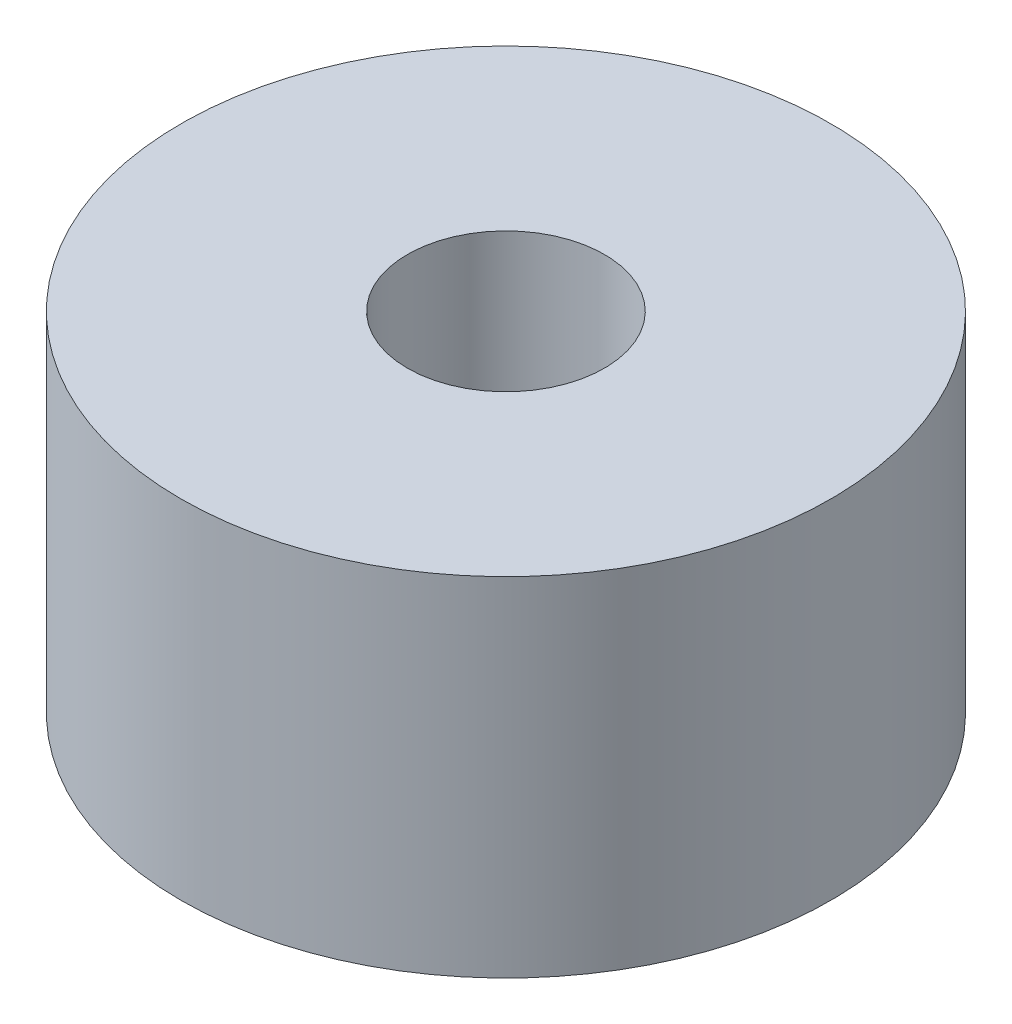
ISO-10303-21;
HEADER;
FILE_DESCRIPTION(('STEP AP214'),'2;1');
FILE_NAME('part.step','',(''),(''),'','','');
FILE_SCHEMA(('AUTOMOTIVE_DESIGN { 1 0 10303 214 1 1 1 1 }'));
ENDSEC;
DATA;
#1=APPLICATION_CONTEXT('core data for automotive mechanical design processes');
#2=APPLICATION_PROTOCOL_DEFINITION('international standard','automotive_design',2000,#1);
#3=PRODUCT_CONTEXT('',#1,'mechanical');
#4=PRODUCT('Part','Part','',(#3));
#5=PRODUCT_RELATED_PRODUCT_CATEGORY('part','',(#4));
#6=PRODUCT_DEFINITION_FORMATION('','',#4);
#7=PRODUCT_DEFINITION_CONTEXT('part definition',#1,'design');
#8=PRODUCT_DEFINITION('design','',#6,#7);
#9=PRODUCT_DEFINITION_SHAPE('','',#8);
#10=(LENGTH_UNIT() NAMED_UNIT(*) SI_UNIT(.MILLI.,.METRE.));
#11=(NAMED_UNIT(*) PLANE_ANGLE_UNIT() SI_UNIT($,.RADIAN.));
#12=(NAMED_UNIT(*) SI_UNIT($,.STERADIAN.) SOLID_ANGLE_UNIT());
#13=UNCERTAINTY_MEASURE_WITH_UNIT(LENGTH_MEASURE(1.E-05),#10,'distance_accuracy_value','');
#14=(GEOMETRIC_REPRESENTATION_CONTEXT(3) GLOBAL_UNCERTAINTY_ASSIGNED_CONTEXT((#13)) GLOBAL_UNIT_ASSIGNED_CONTEXT((#10,
#11,#12)) REPRESENTATION_CONTEXT('',''));
#15=CARTESIAN_POINT('',(0.,0.,0.));
#16=DIRECTION('',(0.,0.,1.));
#17=DIRECTION('',(1.,0.,0.));
#18=AXIS2_PLACEMENT_3D('',#15,#16,#17);
#19=CARTESIAN_POINT('',(0.,2.921,0.));
#20=DIRECTION('',(0.,1.,0.));
#21=DIRECTION('',(0.,0.,1.));
#22=AXIS2_PLACEMENT_3D('',#19,#20,#21);
#23=PLANE('',#22);
#24=CARTESIAN_POINT('',(0.,2.921,0.));
#25=DIRECTION('',(0.,1.,0.));
#26=DIRECTION('',(0.,0.,1.));
#27=AXIS2_PLACEMENT_3D('',#24,#25,#26);
#28=CIRCLE('',#27,2.7305);
#29=CARTESIAN_POINT('',(0.,2.921,2.7305));
#30=VERTEX_POINT('',#29);
#31=EDGE_CURVE('E10',#30,#30,#28,.T.);
#32=ORIENTED_EDGE('',*,*,#31,.T.);
#33=EDGE_LOOP('',(#32));
#34=FACE_BOUND('',#33,.T.);
#35=CARTESIAN_POINT('',(0.,2.921,0.));
#36=DIRECTION('',(0.,1.,0.));
#37=DIRECTION('',(0.,0.,1.));
#38=AXIS2_PLACEMENT_3D('',#35,#36,#37);
#39=CIRCLE('',#38,0.82804);
#40=CARTESIAN_POINT('',(0.,2.921,0.82804));
#41=VERTEX_POINT('',#40);
#42=EDGE_CURVE('E42',#41,#41,#39,.T.);
#43=ORIENTED_EDGE('',*,*,#42,.F.);
#44=EDGE_LOOP('',(#43));
#45=FACE_BOUND('',#44,.T.);
#46=ADVANCED_FACE('F31',(#34,#45),#23,.T.);
#47=CARTESIAN_POINT('',(0.,0.,0.));
#48=DIRECTION('',(0.,1.,0.));
#49=DIRECTION('',(0.,0.,1.));
#50=AXIS2_PLACEMENT_3D('',#47,#48,#49);
#51=PLANE('',#50);
#52=CARTESIAN_POINT('',(0.,0.,0.));
#53=DIRECTION('',(0.,1.,0.));
#54=DIRECTION('',(0.,0.,1.));
#55=AXIS2_PLACEMENT_3D('',#52,#53,#54);
#56=CIRCLE('',#55,2.7305);
#57=CARTESIAN_POINT('',(0.,0.,2.7305));
#58=VERTEX_POINT('',#57);
#59=EDGE_CURVE('E38',#58,#58,#56,.T.);
#60=ORIENTED_EDGE('',*,*,#59,.F.);
#61=EDGE_LOOP('',(#60));
#62=FACE_BOUND('',#61,.T.);
#63=CARTESIAN_POINT('',(0.,0.,0.));
#64=DIRECTION('',(0.,1.,0.));
#65=DIRECTION('',(0.,0.,1.));
#66=AXIS2_PLACEMENT_3D('',#63,#64,#65);
#67=CIRCLE('',#66,0.82804);
#68=CARTESIAN_POINT('',(0.,0.,0.82804));
#69=VERTEX_POINT('',#68);
#70=EDGE_CURVE('E46',#69,#69,#67,.T.);
#71=ORIENTED_EDGE('',*,*,#70,.T.);
#72=EDGE_LOOP('',(#71));
#73=FACE_BOUND('',#72,.T.);
#74=ADVANCED_FACE('F52',(#62,#73),#51,.F.);
#75=CARTESIAN_POINT('',(0.,2.921,0.));
#76=DIRECTION('',(0.,-1.,0.));
#77=DIRECTION('',(0.,0.,-1.));
#78=AXIS2_PLACEMENT_3D('',#75,#76,#77);
#79=CYLINDRICAL_SURFACE('',#78,2.7305);
#80=ORIENTED_EDGE('',*,*,#31,.F.);
#81=EDGE_LOOP('',(#80));
#82=FACE_BOUND('',#81,.T.);
#83=ORIENTED_EDGE('',*,*,#59,.T.);
#84=EDGE_LOOP('',(#83));
#85=FACE_BOUND('',#84,.T.);
#86=ADVANCED_FACE('F33',(#82,#85),#79,.T.);
#87=CARTESIAN_POINT('',(0.,2.921,0.));
#88=DIRECTION('',(0.,-1.,0.));
#89=DIRECTION('',(0.,0.,-1.));
#90=AXIS2_PLACEMENT_3D('',#87,#88,#89);
#91=CYLINDRICAL_SURFACE('',#90,0.82804);
#92=ORIENTED_EDGE('',*,*,#42,.T.);
#93=EDGE_LOOP('',(#92));
#94=FACE_BOUND('',#93,.T.);
#95=ORIENTED_EDGE('',*,*,#70,.F.);
#96=EDGE_LOOP('',(#95));
#97=FACE_BOUND('',#96,.T.);
#98=ADVANCED_FACE('F54',(#94,#97),#91,.F.);
#99=CLOSED_SHELL('',(#46,#74,#86,#98));
#100=MANIFOLD_SOLID_BREP('B2',#99);
#101=ADVANCED_BREP_SHAPE_REPRESENTATION('',(#18,#100),#14);
#102=SHAPE_DEFINITION_REPRESENTATION(#9,#101);
ENDSEC;
END-ISO-10303-21;
